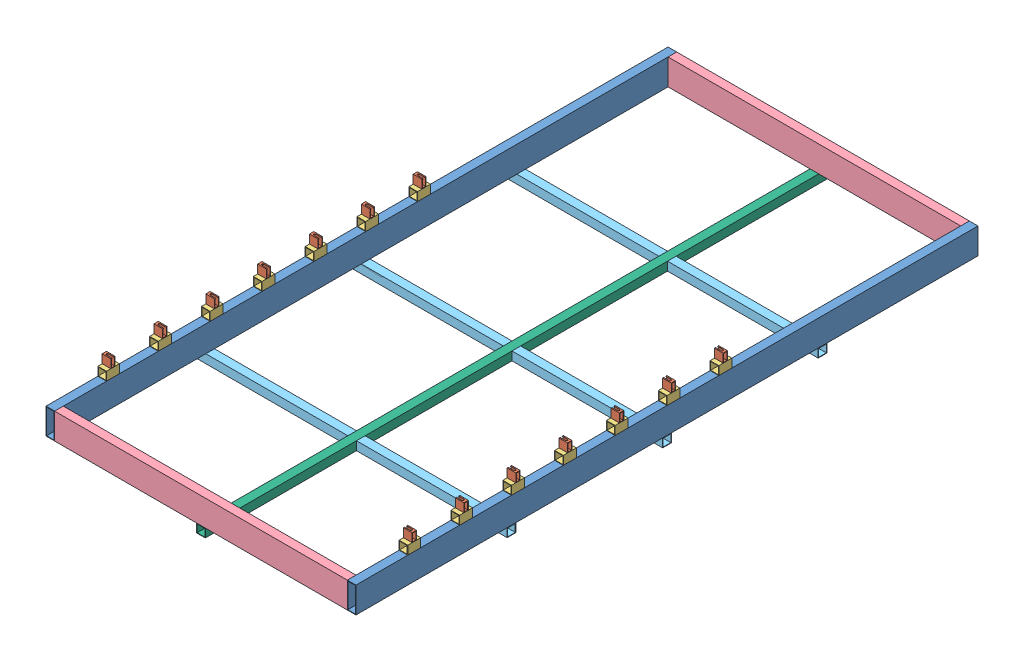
SolidWorks assembly frame.SLDASM, configuration Default (file format 4400). Lengths in mm.
Overall size (1822.45 304.8 3657.6).
40 component instances, 6 part files, 26 mates.
Components (placement in the parent):
- 2x6 tube short-1: 2x6 tube short.SLDPRT [Default] at (168.0761 939.1817 -726.7576) size (50.8 152.4 3657.6)
- 2x6 tube short-2: 2x6 tube short.SLDPRT [Default] at (1939.7261 939.1817 -726.7576) size (50.8 152.4 3657.6)
- gantry spacers-1: gantry spacers.SLDPRT [Default] at (168.0761 1167.7817 2587.9424) x (0 1 0) z (1 0 0) size (50.8 25.4 50.8)
- gantry spacers 2-1: gantry spacers 2.SLDPRT [Default] at (191.6386 1052.0541 2626.0424) x (0 1 0) z (-1 0 0) size (50.8 76.2 50.8)
- tube-1: tube.SLDPRT [Default] at (1939.7261 1091.5817 2930.8424) x (0 0 -1) z (-1 0 0) size (50.8 152.4 1720.85)
- tube 2-1: tube 2.SLDPRT [Default] at (190.3011 913.7817 1102.0424) x (0 0 -1) z (1 0 0) size (50.8 50.8 885.83)
- tube-2: tube.SLDPRT [Default] at (1939.7261 1091.5817 -675.9576) x (0 0 -1) z (-1 0 0) size (50.8 152.4 1720.85)
- tube 3-1: tube 3.SLDPRT [Default] at (1079.3011 913.7817 -726.7576) size (50.8 50.8 3657.6)
- tube 2-2: tube 2.SLDPRT [Default] at (190.3011 913.7817 187.6424) x (0 0 -1) z (1 0 0) size (50.8 50.8 885.83)
- tube 2-3: tube 2.SLDPRT [Default] at (190.3011 913.7817 2016.4424) x (0 0 -1) z (1 0 0) size (50.8 50.8 885.83)
- tube 2-4: tube 2.SLDPRT [Default] at (190.3011 913.7817 1102.0424) x (0 0 -1) z (1 0 0) size (50.8 50.8 885.83)
- tube 2-5: tube 2.SLDPRT [Default] at (1126.9261 913.7817 2016.4424) x (0 0 -1) z (1 0 0) size (50.8 50.8 885.83)
- tube 2-6: tube 2.SLDPRT [Default] at (1126.9261 913.7817 1102.0424) x (0 0 -1) z (1 0 0) size (50.8 50.8 885.83)
- tube 2-7: tube 2.SLDPRT [Default] at (1126.9261 913.7817 187.6424) x (0 0 -1) z (1 0 0) size (50.8 50.8 885.83)
- gantry spacers-2: gantry spacers.SLDPRT [Default] at (168.0761 1167.7817 2283.1424) x (0 1 0) z (1 0 0) size (50.8 25.4 50.8)
- gantry spacers-3: gantry spacers.SLDPRT [Default] at (168.0761 1167.7817 1978.3424) x (0 1 0) z (1 0 0) size (50.8 25.4 50.8)
- gantry spacers-4: gantry spacers.SLDPRT [Default] at (168.0761 1167.7817 1673.5424) x (0 1 0) z (1 0 0) size (50.8 25.4 50.8)
- gantry spacers-5: gantry spacers.SLDPRT [Default] at (168.0761 1167.7817 1368.7424) x (0 1 0) z (1 0 0) size (50.8 25.4 50.8)
- gantry spacers-6: gantry spacers.SLDPRT [Default] at (168.0761 1167.7817 1063.9424) x (0 1 0) z (1 0 0) size (50.8 25.4 50.8)
- gantry spacers-7: gantry spacers.SLDPRT [Default] at (168.0761 1167.7817 759.1424) x (0 1 0) z (1 0 0) size (50.8 25.4 50.8)
- gantry spacers 2-2: gantry spacers 2.SLDPRT [Default] at (191.6386 1052.0541 2321.2424) x (0 1 0) z (-1 0 0) size (50.8 76.2 50.8)
- gantry spacers 2-3: gantry spacers 2.SLDPRT [Default] at (191.6386 1052.0541 2016.4424) x (0 1 0) z (-1 0 0) size (50.8 76.2 50.8)
- gantry spacers 2-4: gantry spacers 2.SLDPRT [Default] at (191.6386 1052.0541 1711.6424) x (0 1 0) z (-1 0 0) size (50.8 76.2 50.8)
- gantry spacers 2-5: gantry spacers 2.SLDPRT [Default] at (191.6386 1052.0541 1406.8424) x (0 1 0) z (-1 0 0) size (50.8 76.2 50.8)
- gantry spacers 2-6: gantry spacers 2.SLDPRT [Default] at (191.6386 1052.0541 1102.0424) x (0 1 0) z (-1 0 0) size (50.8 76.2 50.8)
- gantry spacers 2-7: gantry spacers 2.SLDPRT [Default] at (191.6386 1052.0541 797.2424) x (0 1 0) z (-1 0 0) size (50.8 76.2 50.8)
- gantry spacers-15: gantry spacers.SLDPRT [Default] at (1990.5261 1167.7817 2587.9424) x (0 1 0) z (-1 0 0) size (50.8 25.4 50.8)
- gantry spacers 2-15: gantry spacers 2.SLDPRT [Default] at (1963.2886 1052.0541 2626.0424) x (0 1 0) z (-1 0 0) size (50.8 76.2 50.8)
- gantry spacers-16: gantry spacers.SLDPRT [Default] at (1990.5261 1167.7817 2283.1424) x (0 1 0) z (-1 0 0) size (50.8 25.4 50.8)
- gantry spacers-17: gantry spacers.SLDPRT [Default] at (1990.5261 1167.7817 1978.3424) x (0 1 0) z (-1 0 0) size (50.8 25.4 50.8)
- gantry spacers-18: gantry spacers.SLDPRT [Default] at (1990.5261 1167.7817 1673.5424) x (0 1 0) z (-1 0 0) size (50.8 25.4 50.8)
- gantry spacers-19: gantry spacers.SLDPRT [Default] at (1990.5261 1167.7817 1368.7424) x (0 1 0) z (-1 0 0) size (50.8 25.4 50.8)
- gantry spacers-20: gantry spacers.SLDPRT [Default] at (1990.5261 1167.7817 1063.9424) x (0 1 0) z (-1 0 0) size (50.8 25.4 50.8)
- gantry spacers-21: gantry spacers.SLDPRT [Default] at (1990.5261 1167.7817 759.1424) x (0 1 0) z (-1 0 0) size (50.8 25.4 50.8)
- gantry spacers 2-16: gantry spacers 2.SLDPRT [Default] at (1963.2886 1052.0541 2321.2424) x (0 1 0) z (-1 0 0) size (50.8 76.2 50.8)
- gantry spacers 2-17: gantry spacers 2.SLDPRT [Default] at (1963.2886 1052.0541 2016.4424) x (0 1 0) z (-1 0 0) size (50.8 76.2 50.8)
- gantry spacers 2-18: gantry spacers 2.SLDPRT [Default] at (1963.2886 1052.0541 1711.6424) x (0 1 0) z (-1 0 0) size (50.8 76.2 50.8)
- gantry spacers 2-19: gantry spacers 2.SLDPRT [Default] at (1963.2886 1052.0541 1406.8424) x (0 1 0) z (-1 0 0) size (50.8 76.2 50.8)
- gantry spacers 2-20: gantry spacers 2.SLDPRT [Default] at (1963.2886 1052.0541 1102.0424) x (0 1 0) z (-1 0 0) size (50.8 76.2 50.8)
- gantry spacers 2-21: gantry spacers 2.SLDPRT [Default] at (1963.2886 1052.0541 797.2424) x (0 1 0) z (-1 0 0) size (50.8 76.2 50.8)
Mates (geometry in assembly coordinates):
- Parallel1: parallel aligned: plane of 2x6 tube short-1 through (218.8761 939.1817 -726.7576) normal (1 0 0); plane of 2x6 tube short-2 through (1990.5261 939.1817 -726.7576) normal (1 0 0)
- Coincident2: coincident aligned: plane of 2x6 tube short-1 through (218.8761 1091.5817 -726.7576) normal (0 1 0); plane of 2x6 tube short-2 through (1990.5261 1091.5817 -726.7576) normal (0 1 0)
- Coincident3: coincident aligned: plane of 2x6 tube short-1 through (168.0761 1091.5817 2930.8424) normal (0 0 1); plane of 2x6 tube short-2 through (1939.7261 1091.5817 2930.8424) normal (0 0 1)
- Parallel2: parallel aligned: plane of tube-1 through (1939.7261 1091.5817 2880.0424) normal (0 0 -1); plane of tube-2 through (1939.7261 1091.5817 -726.7576) normal (0 0 -1)
- Coincident5: coincident aligned: plane of tube-1 through (1939.7261 939.1817 2880.0424) normal (0 -1 0); plane of tube-2 through (1939.7261 939.1817 -726.7576) normal (0 -1 0)
- Coincident6: coincident aligned: plane of tube-1 through (218.8761 939.1817 2930.8424) normal (-1 0 0); plane of tube-2 through (218.8761 939.1817 -675.9576) normal (-1 0 0)
- Perpendicular1: perpendicular: plane of 2x6 tube short-1 through (218.8761 939.1817 -726.7576) normal (1 0 0); plane of tube-2 through (1939.7261 1091.5817 -726.7576) normal (0 0 -1)
- Coincident8: coincident aligned: plane of 2x6 tube short-1 through (218.8761 1091.5817 -726.7576) normal (0 1 0); plane of tube-2 through (1939.7261 1091.5817 -675.9576) normal (0 1 0)
- Coincident9: coincident anti-aligned: plane of 2x6 tube short-2 through (1939.7261 1091.5817 -726.7576) normal (-1 0 0); plane of tube-1 through (1939.7261 939.1817 2930.8424) normal (1 0 0)
- Coincident10: coincident aligned: plane of 2x6 tube short-2 through (1939.7261 1091.5817 2930.8424) normal (0 0 1); plane of tube-1 through (1939.7261 939.1817 2930.8424) normal (0 0 1)
- Coincident11: coincident anti-aligned: plane of 2x6 tube short-1 through (218.8761 939.1817 -726.7576) normal (1 0 0); plane of tube-1 through (218.8761 939.1817 2930.8424) normal (-1 0 0)
- Coincident12: coincident aligned: plane of 2x6 tube short-2 through (1939.7261 1091.5817 -726.7576) normal (0 0 -1); plane of tube-2 through (1939.7261 1091.5817 -726.7576) normal (0 0 -1)
- Coincident13: coincident anti-aligned: plane of 2x6 tube short-1 through (168.0761 939.1817 -726.7576) normal (0 -1 0); plane of tube 3-1 through (1104.7011 939.1817 -726.7576) normal (0 1 0)
- Coincident14: coincident: moEndPointRef_w of tube-2; moEndPointRef_w of tube 3-1
- Coincident15: coincident anti-aligned: plane of tube 2-1 through (1053.9011 888.3817 1076.6424) normal (1 0 0); plane of tube 3-1 through (1053.9011 939.1817 -726.7576) normal (-1 0 0)
- Coincident16: coincident aligned: plane of tube 2-1 through (96.2341 888.3817 1127.4424) normal (0 -1 0); plane of tube 3-1 through (1053.9011 888.3817 -726.7576) normal (0 -1 0)
- Coincident17: coincident: moEndPointRef_w of tube 2-1; moEndPointRef_w of tube 3-1
- Coincident18: coincident anti-aligned: plane of 2x6 tube short-1 through (218.8761 1091.5817 -726.7576) normal (0 1 0); plane of gantry spacers 2-1 through (218.8761 1091.5817 2626.0424) normal (0 -1 0)
- Coincident19: coincident aligned: plane of 2x6 tube short-1 through (168.0761 1091.5817 -726.7576) normal (-1 0 0); plane of gantry spacers 2-1 through (168.0761 1091.5817 2626.0424) normal (-1 0 0)
- Coincident20: coincident anti-aligned: plane of gantry spacers-1 through (168.0761 1142.3817 2600.6424) normal (0 -1 0); plane of gantry spacers 2-1 through (168.0761 1142.3817 2626.0424) normal (0 1 0)
- Coincident21: coincident: moEndPointRef_w of gantry spacers-1; moEndPointRef_w of gantry spacers 2-1
- Parallel3: parallel aligned: plane of gantry spacers-1 through (168.0761 1193.1817 2600.6424) normal (0 0 1); plane of gantry spacers 2-1 through (168.0761 1142.3817 2626.0424) normal (0 0 1)
- Distance1: distance aligned: plane of gantry spacers 2-1 through (168.0761 1142.3817 2626.0424) normal (0 0 1); plane of tube-1 through (1939.7261 939.1817 2930.8424) normal (0 0 1)
- PLANE1: unknown: unknown of tube 3-1; unknown of tube 3-1; unknown of tube 3-1
- LocalLPattern2: unknown: line of 2x6 tube short-1 through (218.8761 1091.5817 -726.7576) axis (0 0 1)
- PLANE2: unknown: unknown of tube-1; unknown of tube-1; unknown of tube-2
